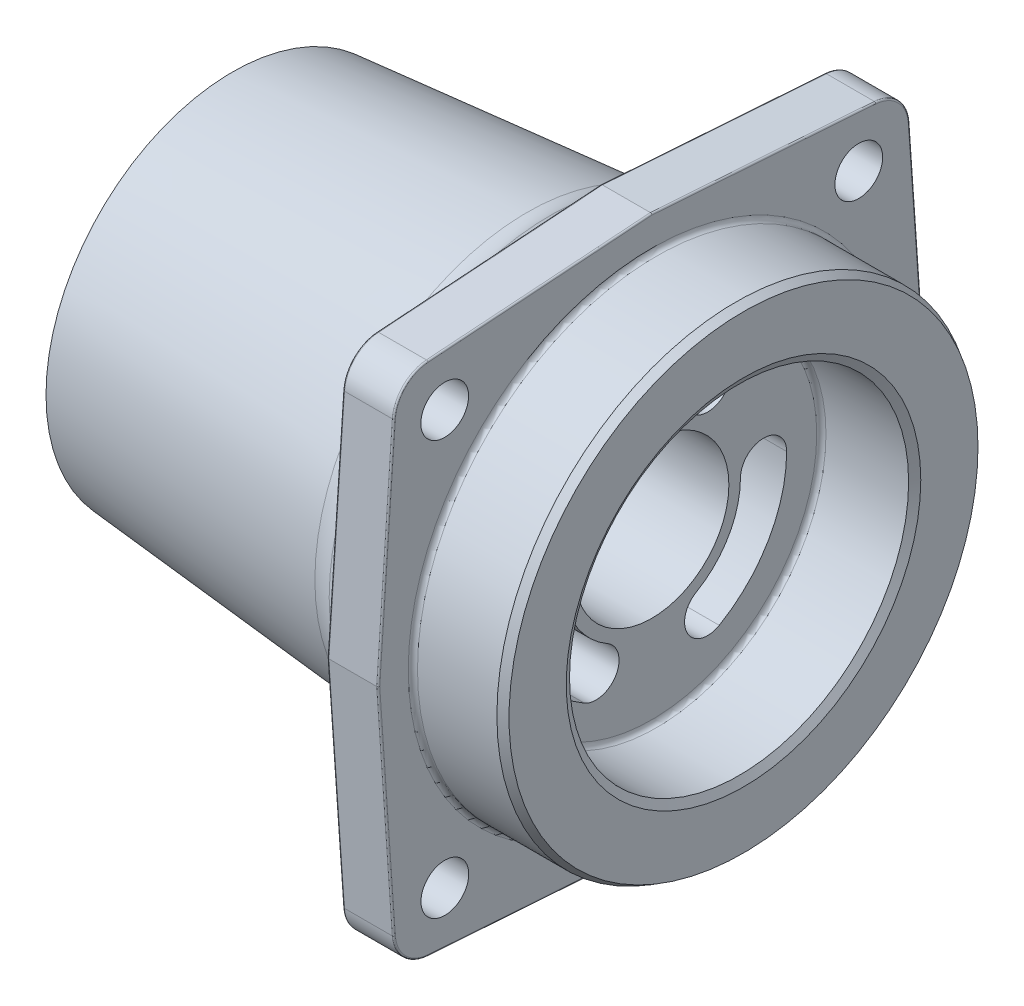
from build123d import *
from OCP.BRepFilletAPI import BRepFilletAPI_MakeChamfer

# Parameters (mm, degrees)
SKETCH1_R               = 15.5
BOSS_EXTRUDE1_DEPTH     = 5.95
SKETCH2_R               = 1.55
BOSS_EXTRUDE4_DEPTH     = 3.3
SKETCH5_R               = 12.1
BOSS_EXTRUDE5_DEPTH     = 23.9
BOSS_EXTRUDE5_DRAFT     = 5
CHAMFER3_SIZE           = 4
CHAMFER3_SIZE2          = 2.441549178
FILLET5_R               = 1
FILLET6_R               = 3
CUT_EXTRUDE1_DEPTH      = 3.3
CUT_EXTRUDE1_DEPTH_BACK = 0.5
SKETCH6_R               = 3
SKETCH7_R               = 11
CUT_EXTRUDE2_DEPTH      = 5.95
SKETCH8_R               = 9.525
CUT_EXTRUDE3_DEPTH      = 5.54
SKETCH9_R               = 5
CUT_EXTRUDE4_DEPTH      = 21.66
CUT_EXTRUDE5_DEPTH      = 21.66
FILLET2_R               = 0.3
CHAMFER1_SIZE           = 0.5
CHAMFER1_SIZE2          = 0.288675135
CHAMFER2_SIZE           = 0.5
CHAMFER2_SIZE2          = 0.288675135
FILLET3_R               = 0.1


with BuildPart() as part:
    # Sketch1 → Boss-Extrude1 (new body)
    with BuildSketch(Plane(origin=(0, 0, 0), x_dir=(0, 0, -1), z_dir=(1, 0, 0))):
        Circle(SKETCH1_R)
    extrude(amount=BOSS_EXTRUDE1_DEPTH)

    # Sketch2 → Boss-Extrude4 (add)
    with BuildSketch(Plane.ZY):
        with BuildLine():
            Line((0, 17.75), (-14.526935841, 16.734177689))
            ThreePointArc((-14.526935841, 16.734177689), (-16.04387998, 16.04283898), (-16.735127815, 14.525853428))
            Line((-16.735127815, 14.525853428), (-17.75, 0))
            Line((-17.75, 0), (-16.734177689, -14.526935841))
            ThreePointArc((-16.734177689, -14.526935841), (-16.04283898, -16.04387998), (-14.525853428, -16.735127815))
            Line((-14.525853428, -16.735127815), (0, -17.75))
            Line((0, -17.75), (14.526935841, -16.734177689))
            ThreePointArc((14.526935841, -16.734177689), (16.04387998, -16.04283898), (16.735127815, -14.525853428))
            Line((16.735127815, -14.525853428), (17.75, 0))
            Line((17.75, 0), (16.734177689, 14.526935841))
            ThreePointArc((16.734177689, 14.526935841), (16.04283898, 16.04387998), (14.525853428, 16.735127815))
            Line((14.525853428, 16.735127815), (0, 17.75))
        make_face()
        with Locations((-13.426215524, 13.425335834)):
            Circle(SKETCH2_R, mode=Mode.SUBTRACT)
        with Locations((13.435028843, 13.435028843)):
            Circle(SKETCH2_R, mode=Mode.SUBTRACT)
        with Locations((13.426215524, -13.425335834)):
            Circle(SKETCH2_R, mode=Mode.SUBTRACT)
        with Locations((-13.435028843, -13.435028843)):
            Circle(SKETCH2_R, mode=Mode.SUBTRACT)
    extrude(amount=BOSS_EXTRUDE4_DEPTH)


with BuildPart() as boss_extrude5_tool:
    # Sketch5 → Boss-Extrude5 (with draft: the straight prism first)
    with BuildSketch(Plane.ZY.offset(27.2)):
        Circle(SKETCH5_R)
    extrude(amount=-BOSS_EXTRUDE5_DEPTH)
    # Boss-Extrude5: the draft: its side faces are tilted about the plane it starts from
    boss_extrude5_sides = [boss_extrude5_tool.faces().sort_by_distance(p)[0] for p in [
        (-15.25, 0, -12.1),
    ]]
    draft(boss_extrude5_sides, Plane.ZY.offset(27.2), BOSS_EXTRUDE5_DRAFT)


with BuildPart() as part_1:
    add(part.part)

    # Boss-Extrude5: add boss_extrude5_tool
    add(boss_extrude5_tool.part)

    # Chamfer3
    chamfer3_edges = [part_1.edges().sort_by_distance(p)[0] for p in [
        (-3.3, 0, -14.190979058),
    ]]
    chamfer3_side = [part_1.faces().sort_by_distance(p)[0] for p in [
        (-15.25, 0, -13.145489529),
    ]]
    chamfer(chamfer3_edges, length=CHAMFER3_SIZE, length2=CHAMFER3_SIZE2, reference=chamfer3_side[0])

    # Fillet5
    fillet5_edges = [part_1.edges().sort_by_distance(p)[0] for p in [
        (-3.3, 0, -16.632528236),
    ]]
    fillet(fillet5_edges, radius=FILLET5_R)

    # Fillet6
    fillet6_edges = [part_1.edges().sort_by_distance(p)[0] for p in [
        (-7.284778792, 0, -13.842356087),
    ]]
    fillet(fillet6_edges, radius=FILLET6_R)

    # Sketch6 → Cut-Extrude1 (cut, two sides: drawn at the far end of the back side and taken through both)
    with BuildSketch(Plane.ZY.offset(3.3).offset(-CUT_EXTRUDE1_DEPTH_BACK)):
        with Locations(Location((-13.426215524, 13.425335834, 0), (0, 0, 266.359380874))):
            Circle(SKETCH6_R)
        with Locations(Location((13.435028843, 13.435028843, 0), (0, 0, 176.656302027))):
            Circle(SKETCH6_R)
        with Locations(Location((13.426215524, -13.425335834, 0), (0, 0, 183.644373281))):
            Circle(SKETCH6_R)
        with Locations(Location((-13.435028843, -13.435028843, 0), (0, 0, 93.343697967))):
            Circle(SKETCH6_R)
    extrude(amount=CUT_EXTRUDE1_DEPTH + CUT_EXTRUDE1_DEPTH_BACK, mode=Mode.SUBTRACT)

    # Sketch7 → Cut-Extrude2 (cut)
    with BuildSketch(Plane(origin=(5.95, 0, 0), x_dir=(0, 0, -1), z_dir=(1, 0, 0))):
        Circle(SKETCH7_R)
    extrude(amount=-CUT_EXTRUDE2_DEPTH, mode=Mode.SUBTRACT)

    # Sketch8 → Cut-Extrude3 (cut)
    with BuildSketch(Plane.ZY.offset(27.2)):
        Circle(SKETCH8_R)
    extrude(amount=-CUT_EXTRUDE3_DEPTH, mode=Mode.SUBTRACT)

    # Sketch9 → Cut-Extrude4 (cut)
    with BuildSketch(Plane(origin=(0, 0, 0), x_dir=(0, 0, -1), z_dir=(1, 0, 0))):
        Circle(SKETCH9_R)
    extrude(amount=-CUT_EXTRUDE4_DEPTH, mode=Mode.SUBTRACT)

    # Sketch10 → Cut-Extrude5 (cut)
    with BuildSketch(Plane(origin=(0, 0, 0), x_dir=(0, 0, -1), z_dir=(1, 0, 0))):
        with BuildLine():
            ThreePointArc((4.375, 7.577722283), (0, 8.75), (-4.375, 7.577722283))
            ThreePointArc((-4.375, 7.577722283), (-4.924038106, 5.528684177), (-2.875, 4.979646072))
            ThreePointArc((-2.875, 4.979646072), (0, 5.75), (2.875, 4.979646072))
            ThreePointArc((2.875, 4.979646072), (4.924038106, 5.528684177), (4.375, 7.577722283))
        make_face()
        with BuildLine():
            ThreePointArc((4.375, -7.577722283), (7.577722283, -4.375), (8.75, 0))
            ThreePointArc((8.75, 0), (7.25, 1.5), (5.75, 0))
            ThreePointArc((5.75, 0), (4.979646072, -2.875), (2.875, -4.979646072))
            ThreePointArc((2.875, -4.979646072), (2.325961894, -7.028684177), (4.375, -7.577722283))
        make_face()
        with BuildLine():
            ThreePointArc((-8.75, 0), (-7.577722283, -4.375), (-4.375, -7.577722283))
            ThreePointArc((-4.375, -7.577722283), (-2.325961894, -7.028684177), (-2.875, -4.979646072))
            ThreePointArc((-2.875, -4.979646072), (-4.979646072, -2.875), (-5.75, 0))
            ThreePointArc((-5.75, 0), (-7.25, 1.5), (-8.75, 0))
        make_face()
    extrude(amount=-CUT_EXTRUDE5_DEPTH, mode=Mode.SUBTRACT)

    # Fillet2
    fillet2_edges = [part_1.edges().sort_by_distance(p)[0] for p in [
        (-21.66, 0, -9.525),
        (0, 0, 15.5),
        (0, 0, 11),
    ]]
    fillet(fillet2_edges, radius=FILLET2_R)

    # Chamfer1: one chamfer whose edges measure the first distance from different faces: ONE call of the kernel's chamfer builder (chamfer() names one face for all edges)
    chamfer1_edges_1 = [part_1.edges().sort_by_distance(p)[0] for p in [
        (5.95, 0, 15.5),
    ]]
    chamfer1_side_1 = [part_1.faces().sort_by_distance(p)[0] for p in [
        (3.125, 0, 15.5),
    ]]
    chamfer1_edges_2 = [part_1.edges().sort_by_distance(p)[0] for p in [
        (5.95, 0, 11),
    ]]
    chamfer1_side_2 = [part_1.faces().sort_by_distance(p)[0] for p in [
        (5.95, 0, 15.061593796),
    ]]
    chamfer1 = BRepFilletAPI_MakeChamfer(part_1.part.solid().wrapped)
    for e in chamfer1_edges_1:
        chamfer1.Add(CHAMFER1_SIZE, CHAMFER1_SIZE2, e.wrapped, chamfer1_side_1[0].wrapped)  # the first distance lies on this face
    for e in chamfer1_edges_2:
        chamfer1.Add(CHAMFER1_SIZE, CHAMFER1_SIZE2, e.wrapped, chamfer1_side_2[0].wrapped)  # the first distance lies on this face
    add(Compound.cast(chamfer1.Shape()), mode=Mode.REPLACE)

    # Chamfer2
    chamfer2_edges = [part_1.edges().sort_by_distance(p)[0] for p in [
        (-27.2, 0, -9.525),
    ]]
    chamfer2_side = [part_1.faces().sort_by_distance(p)[0] for p in [
        (-24.58, 0, -9.525),
    ]]
    chamfer(chamfer2_edges, length=CHAMFER2_SIZE, length2=CHAMFER2_SIZE2, reference=chamfer2_side[0])

    # Fillet3
    fillet3_edges = [part_1.edges().sort_by_distance(p)[0] for p in [
        (-3.3, 16.04387998, 16.04283898),
        (0, 17.242563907, 7.262926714),
        (0, 17.242088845, -7.263467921),
        (0, 16.04283898, -16.04387998),
        (0, 7.262926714, -17.242563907),
        (0, -7.263467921, -17.242088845),
        (0, -16.04387998, -16.04283898),
        (0, -17.242563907, -7.262926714),
        (0, -17.242088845, 7.263467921),
        (0, -16.04283898, 16.04387998),
        (0, -7.262926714, 17.242563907),
        (0, 7.263467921, 17.242088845),
        (0, 16.04387998, 16.04283898),
        (-3.3, 17.242563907, 7.262926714),
        (-3.3, 17.242088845, -7.263467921),
        (-3.3, 16.04283898, -16.04387998),
        (-3.3, 7.262926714, -17.242563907),
        (-3.3, -7.263467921, -17.242088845),
        (-3.3, -16.04387998, -16.04283898),
        (-3.3, -17.242563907, -7.262926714),
        (-3.3, -17.242088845, 7.263467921),
        (-3.3, -16.04283898, 16.04387998),
        (-3.3, -7.262926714, 17.242563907),
        (-3.3, 7.263467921, 17.242088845),
    ]]
    fillet(fillet3_edges, radius=FILLET3_R)


solid = part_1.part
